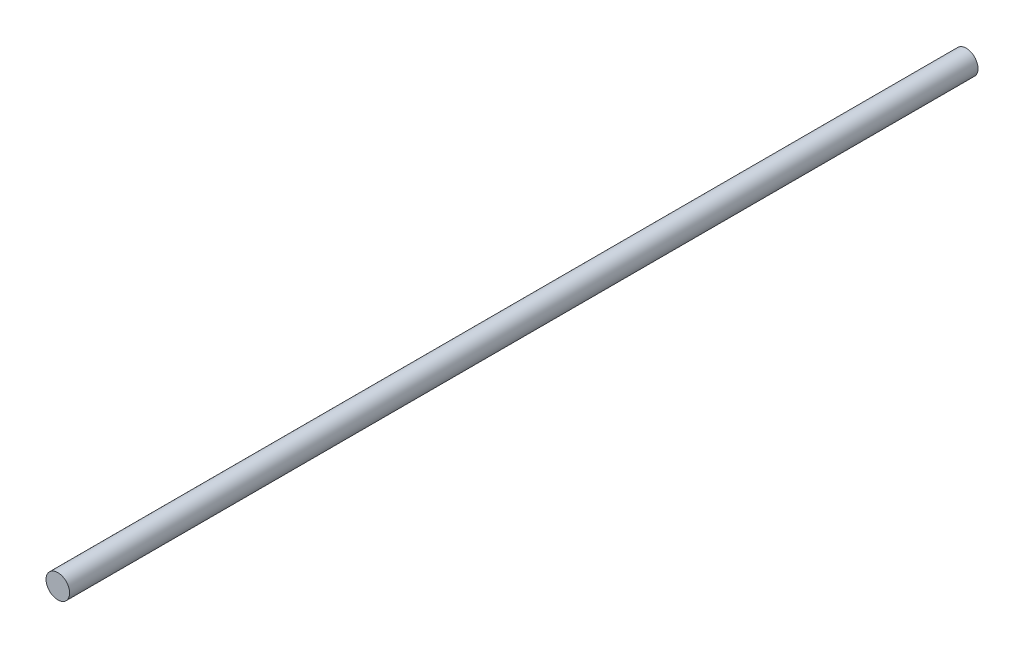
ISO-10303-21;
HEADER;
FILE_DESCRIPTION(('STEP AP214'),'2;1');
FILE_NAME('part.step','',(''),(''),'','','');
FILE_SCHEMA(('AUTOMOTIVE_DESIGN { 1 0 10303 214 1 1 1 1 }'));
ENDSEC;
DATA;
#1=APPLICATION_CONTEXT('core data for automotive mechanical design processes');
#2=APPLICATION_PROTOCOL_DEFINITION('international standard','automotive_design',2000,#1);
#3=PRODUCT_CONTEXT('',#1,'mechanical');
#4=PRODUCT('Part','Part','',(#3));
#5=PRODUCT_RELATED_PRODUCT_CATEGORY('part','',(#4));
#6=PRODUCT_DEFINITION_FORMATION('','',#4);
#7=PRODUCT_DEFINITION_CONTEXT('part definition',#1,'design');
#8=PRODUCT_DEFINITION('design','',#6,#7);
#9=PRODUCT_DEFINITION_SHAPE('','',#8);
#10=(LENGTH_UNIT() NAMED_UNIT(*) SI_UNIT(.MILLI.,.METRE.));
#11=(NAMED_UNIT(*) PLANE_ANGLE_UNIT() SI_UNIT($,.RADIAN.));
#12=(NAMED_UNIT(*) SI_UNIT($,.STERADIAN.) SOLID_ANGLE_UNIT());
#13=UNCERTAINTY_MEASURE_WITH_UNIT(LENGTH_MEASURE(1.E-05),#10,'distance_accuracy_value','');
#14=(GEOMETRIC_REPRESENTATION_CONTEXT(3) GLOBAL_UNCERTAINTY_ASSIGNED_CONTEXT((#13)) GLOBAL_UNIT_ASSIGNED_CONTEXT((#10,
#11,#12)) REPRESENTATION_CONTEXT('',''));
#15=CARTESIAN_POINT('',(0.,0.,0.));
#16=DIRECTION('',(0.,0.,1.));
#17=DIRECTION('',(1.,0.,0.));
#18=AXIS2_PLACEMENT_3D('',#15,#16,#17);
#19=CARTESIAN_POINT('',(0.,0.,244.));
#20=DIRECTION('',(0.,0.,-1.));
#21=DIRECTION('',(-1.,0.,0.));
#22=AXIS2_PLACEMENT_3D('',#19,#20,#21);
#23=CYLINDRICAL_SURFACE('',#22,3.175);
#24=CARTESIAN_POINT('',(0.,0.,244.));
#25=DIRECTION('',(0.,0.,1.));
#26=DIRECTION('',(1.,0.,0.));
#27=AXIS2_PLACEMENT_3D('',#24,#25,#26);
#28=CIRCLE('',#27,3.175);
#29=CARTESIAN_POINT('',(-3.175,0.,244.));
#30=VERTEX_POINT('',#29);
#31=EDGE_CURVE('E10',#30,#30,#28,.T.);
#32=CARTESIAN_POINT('',(0.,0.,0.));
#33=DIRECTION('',(0.,0.,1.));
#34=DIRECTION('',(1.,0.,0.));
#35=AXIS2_PLACEMENT_3D('',#32,#33,#34);
#36=CIRCLE('',#35,3.175);
#37=CARTESIAN_POINT('',(-3.175,0.,0.));
#38=VERTEX_POINT('',#37);
#39=EDGE_CURVE('E32',#38,#38,#36,.T.);
#40=CARTESIAN_POINT('',(-3.175,0.,244.));
#41=CARTESIAN_POINT('',(-3.175,0.,241.458333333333));
#42=CARTESIAN_POINT('',(-3.175,0.,238.916666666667));
#43=CARTESIAN_POINT('',(-3.175,0.,233.833333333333));
#44=CARTESIAN_POINT('',(-3.175,0.,231.291666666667));
#45=CARTESIAN_POINT('',(-3.175,0.,226.208333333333));
#46=CARTESIAN_POINT('',(-3.175,0.,223.666666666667));
#47=CARTESIAN_POINT('',(-3.175,0.,218.583333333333));
#48=CARTESIAN_POINT('',(-3.175,0.,216.041666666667));
#49=CARTESIAN_POINT('',(-3.175,0.,210.958333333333));
#50=CARTESIAN_POINT('',(-3.175,0.,208.416666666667));
#51=CARTESIAN_POINT('',(-3.175,0.,203.333333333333));
#52=CARTESIAN_POINT('',(-3.175,0.,200.791666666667));
#53=CARTESIAN_POINT('',(-3.175,0.,195.708333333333));
#54=CARTESIAN_POINT('',(-3.175,0.,193.166666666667));
#55=CARTESIAN_POINT('',(-3.175,0.,188.083333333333));
#56=CARTESIAN_POINT('',(-3.175,0.,185.541666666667));
#57=CARTESIAN_POINT('',(-3.175,0.,180.458333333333));
#58=CARTESIAN_POINT('',(-3.175,0.,177.916666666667));
#59=CARTESIAN_POINT('',(-3.175,0.,172.833333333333));
#60=CARTESIAN_POINT('',(-3.175,0.,170.291666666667));
#61=CARTESIAN_POINT('',(-3.175,0.,165.208333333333));
#62=CARTESIAN_POINT('',(-3.175,0.,162.666666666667));
#63=CARTESIAN_POINT('',(-3.175,0.,157.583333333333));
#64=CARTESIAN_POINT('',(-3.175,0.,155.041666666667));
#65=CARTESIAN_POINT('',(-3.175,0.,149.958333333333));
#66=CARTESIAN_POINT('',(-3.175,0.,147.416666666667));
#67=CARTESIAN_POINT('',(-3.175,0.,142.333333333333));
#68=CARTESIAN_POINT('',(-3.175,0.,139.791666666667));
#69=CARTESIAN_POINT('',(-3.175,0.,134.708333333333));
#70=CARTESIAN_POINT('',(-3.175,0.,132.166666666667));
#71=CARTESIAN_POINT('',(-3.175,0.,127.083333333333));
#72=CARTESIAN_POINT('',(-3.175,0.,124.541666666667));
#73=CARTESIAN_POINT('',(-3.175,0.,119.458333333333));
#74=CARTESIAN_POINT('',(-3.175,0.,116.916666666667));
#75=CARTESIAN_POINT('',(-3.175,0.,111.833333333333));
#76=CARTESIAN_POINT('',(-3.175,0.,109.291666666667));
#77=CARTESIAN_POINT('',(-3.175,0.,104.208333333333));
#78=CARTESIAN_POINT('',(-3.175,0.,101.666666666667));
#79=CARTESIAN_POINT('',(-3.175,0.,96.5833333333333));
#80=CARTESIAN_POINT('',(-3.175,0.,94.0416666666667));
#81=CARTESIAN_POINT('',(-3.175,0.,88.9583333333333));
#82=CARTESIAN_POINT('',(-3.175,0.,86.4166666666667));
#83=CARTESIAN_POINT('',(-3.175,0.,81.3333333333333));
#84=CARTESIAN_POINT('',(-3.175,0.,78.7916666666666));
#85=CARTESIAN_POINT('',(-3.175,0.,73.7083333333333));
#86=CARTESIAN_POINT('',(-3.175,0.,71.1666666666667));
#87=CARTESIAN_POINT('',(-3.175,0.,66.0833333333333));
#88=CARTESIAN_POINT('',(-3.175,0.,63.5416666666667));
#89=CARTESIAN_POINT('',(-3.175,0.,58.4583333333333));
#90=CARTESIAN_POINT('',(-3.175,0.,55.9166666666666));
#91=CARTESIAN_POINT('',(-3.175,0.,50.8333333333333));
#92=CARTESIAN_POINT('',(-3.175,0.,48.2916666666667));
#93=CARTESIAN_POINT('',(-3.175,0.,43.2083333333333));
#94=CARTESIAN_POINT('',(-3.175,0.,40.6666666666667));
#95=CARTESIAN_POINT('',(-3.175,0.,35.5833333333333));
#96=CARTESIAN_POINT('',(-3.175,0.,33.0416666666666));
#97=CARTESIAN_POINT('',(-3.175,0.,27.9583333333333));
#98=CARTESIAN_POINT('',(-3.175,0.,25.4166666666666));
#99=CARTESIAN_POINT('',(-3.175,0.,20.3333333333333));
#100=CARTESIAN_POINT('',(-3.175,0.,17.7916666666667));
#101=CARTESIAN_POINT('',(-3.175,0.,12.7083333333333));
#102=CARTESIAN_POINT('',(-3.175,0.,10.1666666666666));
#103=CARTESIAN_POINT('',(-3.175,0.,5.0833333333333));
#104=CARTESIAN_POINT('',(-3.175,0.,2.54166666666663));
#105=CARTESIAN_POINT('',(-3.175,0.,0.));
#106=B_SPLINE_CURVE_WITH_KNOTS('',3,(#40,#41,#42,#43,#44,#45,#46,#47,#48,#49,#50,#51,#52,#53,
#54,#55,#56,#57,#58,#59,#60,#61,#62,#63,#64,#65,#66,#67,#68,#69,#70,#71,#72,#73,#74,#75,#76,#77,
#78,#79,#80,#81,#82,#83,#84,#85,#86,#87,#88,#89,#90,#91,#92,#93,#94,#95,#96,#97,#98,#99,#100,
#101,#102,#103,#104,#105),.UNSPECIFIED.,.F.,.F.,(4,2,2,2,2,2,2,2,2,2,2,2,2,2,2,2,2,2,2,2,2,2,2,
2,2,2,2,2,2,2,2,2,4),(0.,7.62500000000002,15.25,22.875,30.5,38.125,45.75,53.375,61.,68.625,
76.25,83.875,91.5,99.125,106.75,114.375,122.,129.625,137.25,144.875,152.5,160.125,167.75,
175.375,183.,190.625,198.25,205.875,213.5,221.125,228.75,236.375,244.),.UNSPECIFIED.);
#107=EDGE_CURVE('BSEAM29',#30,#38,#106,.T.);
#108=ORIENTED_EDGE('',*,*,#31,.F.);
#109=ORIENTED_EDGE('',*,*,#39,.T.);
#110=ORIENTED_EDGE('',*,*,#107,.T.);
#111=ORIENTED_EDGE('',*,*,#107,.F.);
#112=EDGE_LOOP('',(#108,#110,#109,#111));
#113=FACE_BOUND('',#112,.T.);
#114=ADVANCED_FACE('F29',(#113),#23,.T.);
#115=CARTESIAN_POINT('',(0.,0.,244.));
#116=DIRECTION('',(0.,0.,1.));
#117=DIRECTION('',(1.,0.,0.));
#118=AXIS2_PLACEMENT_3D('',#115,#116,#117);
#119=PLANE('',#118);
#120=ORIENTED_EDGE('',*,*,#31,.T.);
#121=EDGE_LOOP('',(#120));
#122=FACE_BOUND('',#121,.T.);
#123=ADVANCED_FACE('F44',(#122),#119,.T.);
#124=CARTESIAN_POINT('',(0.,0.,0.));
#125=DIRECTION('',(0.,0.,1.));
#126=DIRECTION('',(1.,0.,0.));
#127=AXIS2_PLACEMENT_3D('',#124,#125,#126);
#128=PLANE('',#127);
#129=ORIENTED_EDGE('',*,*,#39,.F.);
#130=EDGE_LOOP('',(#129));
#131=FACE_BOUND('',#130,.T.);
#132=ADVANCED_FACE('F42',(#131),#128,.F.);
#133=CLOSED_SHELL('',(#114,#123,#132));
#134=MANIFOLD_SOLID_BREP('B2',#133);
#135=ADVANCED_BREP_SHAPE_REPRESENTATION('',(#18,#134),#14);
#136=SHAPE_DEFINITION_REPRESENTATION(#9,#135);
ENDSEC;
END-ISO-10303-21;
